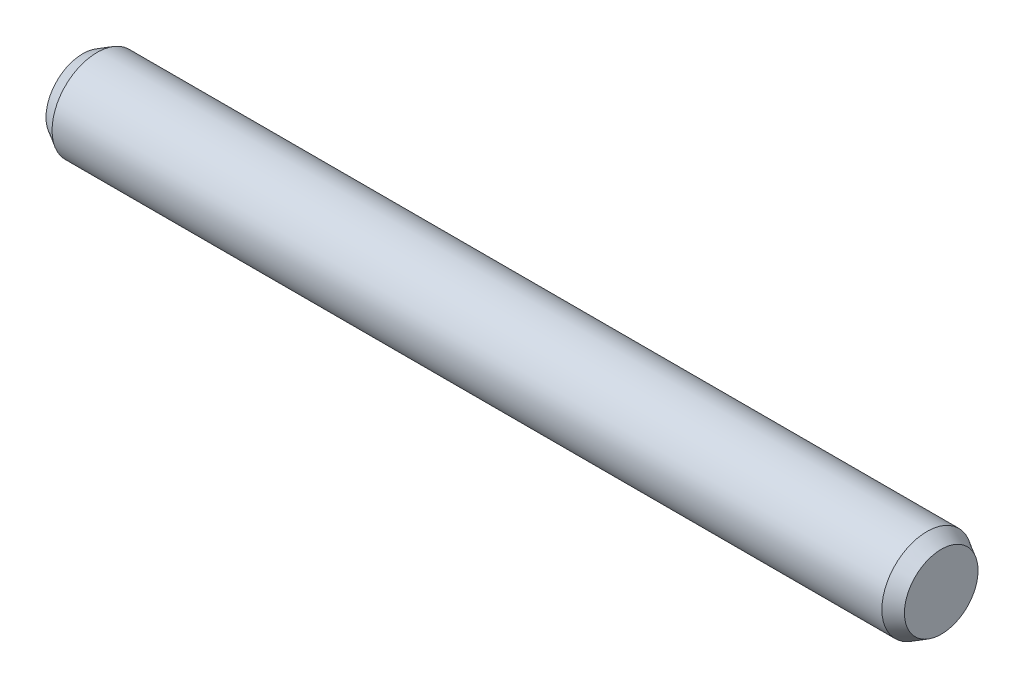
from build123d import *


with BuildPart() as part:
    # Sketch2 → Revolve1 (revolve)
    with BuildSketch(Plane.XY, mode=Mode.PRIVATE) as revolve1_sk:
        Polygon((0, 0), (0, 0.653453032), (0.254, 0.8001), (14.986, 0.8001), (15.24, 0.653453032), (15.24, 0), align=None)
    revolve(revolve1_sk.sketch.rotate(Axis((0, 0, 0), (1, 0, 0)), 90), axis=Axis((0, 0, 0), (1, 0, 0)))


solid = part.part
